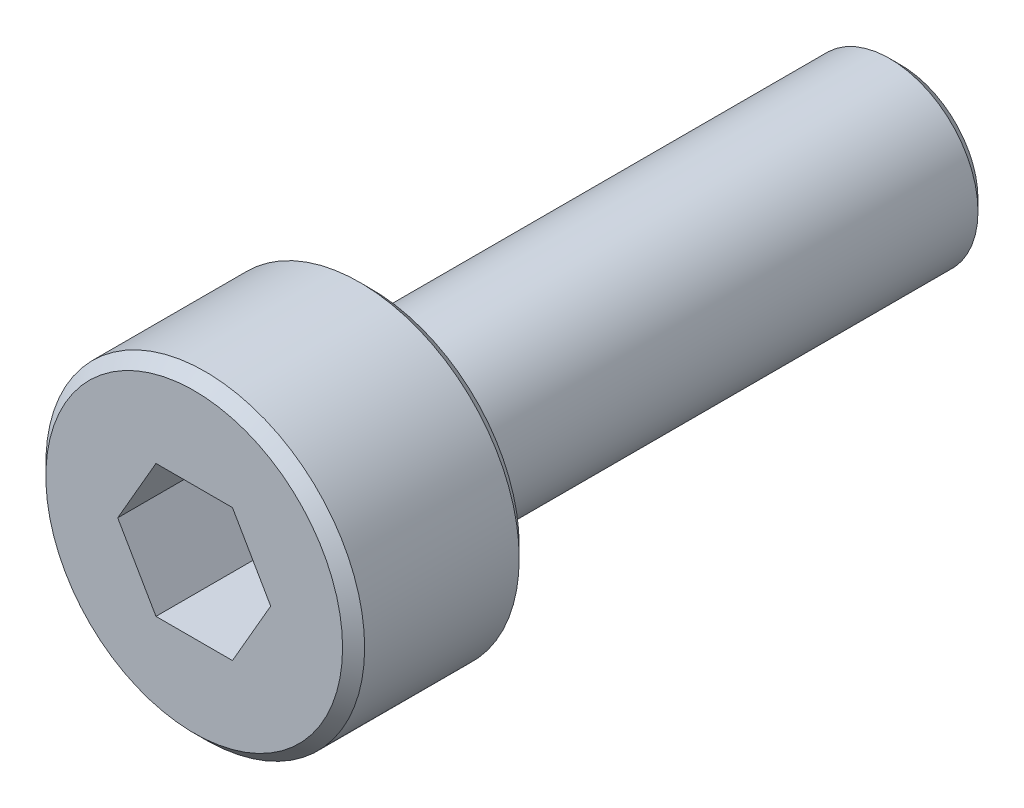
ISO-10303-21;
HEADER;
FILE_DESCRIPTION(('STEP AP214'),'2;1');
FILE_NAME('part.step','',(''),(''),'','','');
FILE_SCHEMA(('AUTOMOTIVE_DESIGN { 1 0 10303 214 1 1 1 1 }'));
ENDSEC;
DATA;
#1=APPLICATION_CONTEXT('core data for automotive mechanical design processes');
#2=APPLICATION_PROTOCOL_DEFINITION('international standard','automotive_design',2000,#1);
#3=PRODUCT_CONTEXT('',#1,'mechanical');
#4=PRODUCT('Part','Part','',(#3));
#5=PRODUCT_RELATED_PRODUCT_CATEGORY('part','',(#4));
#6=PRODUCT_DEFINITION_FORMATION('','',#4);
#7=PRODUCT_DEFINITION_CONTEXT('part definition',#1,'design');
#8=PRODUCT_DEFINITION('design','',#6,#7);
#9=PRODUCT_DEFINITION_SHAPE('','',#8);
#10=(LENGTH_UNIT() NAMED_UNIT(*) SI_UNIT(.MILLI.,.METRE.));
#11=(NAMED_UNIT(*) PLANE_ANGLE_UNIT() SI_UNIT($,.RADIAN.));
#12=(NAMED_UNIT(*) SI_UNIT($,.STERADIAN.) SOLID_ANGLE_UNIT());
#13=UNCERTAINTY_MEASURE_WITH_UNIT(LENGTH_MEASURE(1.E-05),#10,'distance_accuracy_value','');
#14=(GEOMETRIC_REPRESENTATION_CONTEXT(3) GLOBAL_UNCERTAINTY_ASSIGNED_CONTEXT((#13)) GLOBAL_UNIT_ASSIGNED_CONTEXT((#10,
#11,#12)) REPRESENTATION_CONTEXT('',''));
#15=CARTESIAN_POINT('',(0.,0.,0.));
#16=DIRECTION('',(0.,0.,1.));
#17=DIRECTION('',(1.,0.,0.));
#18=AXIS2_PLACEMENT_3D('',#15,#16,#17);
#19=CARTESIAN_POINT('',(0.,0.,12.));
#20=DIRECTION('',(0.,0.,-1.));
#21=DIRECTION('',(-1.,0.,0.));
#22=AXIS2_PLACEMENT_3D('',#19,#20,#21);
#23=CYLINDRICAL_SURFACE('',#22,2.);
#24=CARTESIAN_POINT('',(0.,0.,0.249999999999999));
#25=DIRECTION('',(0.,0.,1.));
#26=DIRECTION('',(1.,0.,0.));
#27=AXIS2_PLACEMENT_3D('',#24,#25,#26);
#28=CIRCLE('',#27,2.);
#29=CARTESIAN_POINT('',(2.,0.,0.249999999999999));
#30=VERTEX_POINT('',#29);
#31=EDGE_CURVE('E176',#30,#30,#28,.T.);
#32=ORIENTED_EDGE('',*,*,#31,.T.);
#33=EDGE_LOOP('',(#32));
#34=FACE_BOUND('',#33,.T.);
#35=CARTESIAN_POINT('',(0.,0.,12.));
#36=DIRECTION('',(0.,0.,1.));
#37=DIRECTION('',(1.,0.,0.));
#38=AXIS2_PLACEMENT_3D('',#35,#36,#37);
#39=CIRCLE('',#38,2.);
#40=CARTESIAN_POINT('',(2.,0.,12.));
#41=VERTEX_POINT('',#40);
#42=EDGE_CURVE('E162',#41,#41,#39,.T.);
#43=ORIENTED_EDGE('',*,*,#42,.F.);
#44=EDGE_LOOP('',(#43));
#45=FACE_BOUND('',#44,.T.);
#46=ADVANCED_FACE('F50',(#34,#45),#23,.T.);
#47=CARTESIAN_POINT('',(0.,0.,0.));
#48=DIRECTION('',(0.,0.,1.));
#49=DIRECTION('',(1.,0.,0.));
#50=AXIS2_PLACEMENT_3D('',#47,#48,#49);
#51=PLANE('',#50);
#52=CARTESIAN_POINT('',(0.,0.,0.));
#53=DIRECTION('',(0.,0.,1.));
#54=DIRECTION('',(1.,0.,0.));
#55=AXIS2_PLACEMENT_3D('',#52,#53,#54);
#56=CIRCLE('',#55,1.75);
#57=CARTESIAN_POINT('',(1.75,0.,0.));
#58=VERTEX_POINT('',#57);
#59=EDGE_CURVE('E179',#58,#58,#56,.F.);
#60=ORIENTED_EDGE('',*,*,#59,.T.);
#61=EDGE_LOOP('',(#60));
#62=FACE_BOUND('',#61,.T.);
#63=ADVANCED_FACE('F208',(#62),#51,.F.);
#64=CARTESIAN_POINT('',(0.,0.,16.));
#65=DIRECTION('',(0.,0.,-1.));
#66=DIRECTION('',(-1.,0.,0.));
#67=AXIS2_PLACEMENT_3D('',#64,#65,#66);
#68=CYLINDRICAL_SURFACE('',#67,3.61);
#69=CARTESIAN_POINT('',(0.,0.,12.25));
#70=DIRECTION('',(0.,0.,1.));
#71=DIRECTION('',(1.,0.,0.));
#72=AXIS2_PLACEMENT_3D('',#69,#70,#71);
#73=CIRCLE('',#72,3.61);
#74=CARTESIAN_POINT('',(3.61,0.,12.25));
#75=VERTEX_POINT('',#74);
#76=EDGE_CURVE('E190',#75,#75,#73,.T.);
#77=ORIENTED_EDGE('',*,*,#76,.T.);
#78=EDGE_LOOP('',(#77));
#79=FACE_BOUND('',#78,.T.);
#80=CARTESIAN_POINT('',(0.,0.,15.75));
#81=DIRECTION('',(0.,0.,1.));
#82=DIRECTION('',(1.,0.,0.));
#83=AXIS2_PLACEMENT_3D('',#80,#81,#82);
#84=CIRCLE('',#83,3.61);
#85=CARTESIAN_POINT('',(3.61,0.,15.75));
#86=VERTEX_POINT('',#85);
#87=EDGE_CURVE('E184',#86,#86,#84,.F.);
#88=ORIENTED_EDGE('',*,*,#87,.T.);
#89=EDGE_LOOP('',(#88));
#90=FACE_BOUND('',#89,.T.);
#91=ADVANCED_FACE('F204',(#79,#90),#68,.T.);
#92=CARTESIAN_POINT('',(0.,0.,16.));
#93=DIRECTION('',(0.,0.,1.));
#94=DIRECTION('',(1.,0.,0.));
#95=AXIS2_PLACEMENT_3D('',#92,#93,#94);
#96=PLANE('',#95);
#97=CARTESIAN_POINT('',(0.,0.,16.));
#98=DIRECTION('',(0.,0.,1.));
#99=DIRECTION('',(1.,0.,0.));
#100=AXIS2_PLACEMENT_3D('',#97,#98,#99);
#101=CIRCLE('',#100,3.36);
#102=CARTESIAN_POINT('',(3.36,0.,16.));
#103=VERTEX_POINT('',#102);
#104=EDGE_CURVE('E11',#103,#103,#101,.T.);
#105=ORIENTED_EDGE('',*,*,#104,.T.);
#106=EDGE_LOOP('',(#105));
#107=FACE_BOUND('',#106,.T.);
#108=DIRECTION('',(0.5,0.866025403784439,0.));
#109=VECTOR('',#108,1.);
#110=CARTESIAN_POINT('',(0.866025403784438,-1.5,16.));
#111=LINE('',#110,#109);
#112=CARTESIAN_POINT('',(0.866025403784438,-1.5,16.));
#113=VERTEX_POINT('',#112);
#114=CARTESIAN_POINT('',(1.73205080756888,0.,16.));
#115=VERTEX_POINT('',#114);
#116=EDGE_CURVE('E61',#113,#115,#111,.T.);
#117=ORIENTED_EDGE('',*,*,#116,.F.);
#118=DIRECTION('',(1.,0.,0.));
#119=VECTOR('',#118,1.);
#120=CARTESIAN_POINT('',(-0.866025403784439,-1.5,16.));
#121=LINE('',#120,#119);
#122=CARTESIAN_POINT('',(-0.866025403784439,-1.5,16.));
#123=VERTEX_POINT('',#122);
#124=EDGE_CURVE('E160',#123,#113,#121,.T.);
#125=ORIENTED_EDGE('',*,*,#124,.F.);
#126=DIRECTION('',(0.5,-0.866025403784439,0.));
#127=VECTOR('',#126,1.);
#128=CARTESIAN_POINT('',(-1.73205080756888,0.,16.));
#129=LINE('',#128,#127);
#130=CARTESIAN_POINT('',(-1.73205080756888,0.,16.));
#131=VERTEX_POINT('',#130);
#132=EDGE_CURVE('E152',#131,#123,#129,.T.);
#133=ORIENTED_EDGE('',*,*,#132,.F.);
#134=DIRECTION('',(-0.5,-0.866025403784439,0.));
#135=VECTOR('',#134,1.);
#136=CARTESIAN_POINT('',(-0.866025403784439,1.5,16.));
#137=LINE('',#136,#135);
#138=CARTESIAN_POINT('',(-0.866025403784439,1.5,16.));
#139=VERTEX_POINT('',#138);
#140=EDGE_CURVE('E115',#139,#131,#137,.T.);
#141=ORIENTED_EDGE('',*,*,#140,.F.);
#142=DIRECTION('',(-1.,0.,0.));
#143=VECTOR('',#142,1.);
#144=CARTESIAN_POINT('',(0.866025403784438,1.5,16.));
#145=LINE('',#144,#143);
#146=CARTESIAN_POINT('',(0.866025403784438,1.5,16.));
#147=VERTEX_POINT('',#146);
#148=EDGE_CURVE('E146',#147,#139,#145,.T.);
#149=ORIENTED_EDGE('',*,*,#148,.F.);
#150=DIRECTION('',(-0.5,0.866025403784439,0.));
#151=VECTOR('',#150,1.);
#152=CARTESIAN_POINT('',(1.73205080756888,0.,16.));
#153=LINE('',#152,#151);
#154=EDGE_CURVE('E145',#115,#147,#153,.T.);
#155=ORIENTED_EDGE('',*,*,#154,.F.);
#156=EDGE_LOOP('',(#117,#125,#133,#141,#149,#155));
#157=FACE_BOUND('',#156,.T.);
#158=ADVANCED_FACE('F210',(#107,#157),#96,.T.);
#159=CARTESIAN_POINT('',(0.,0.,12.));
#160=DIRECTION('',(0.,0.,1.));
#161=DIRECTION('',(1.,0.,0.));
#162=AXIS2_PLACEMENT_3D('',#159,#160,#161);
#163=PLANE('',#162);
#164=CARTESIAN_POINT('',(0.,0.,12.));
#165=DIRECTION('',(0.,0.,1.));
#166=DIRECTION('',(1.,0.,0.));
#167=AXIS2_PLACEMENT_3D('',#164,#165,#166);
#168=CIRCLE('',#167,3.36);
#169=CARTESIAN_POINT('',(3.36,0.,12.));
#170=VERTEX_POINT('',#169);
#171=EDGE_CURVE('E60',#170,#170,#168,.F.);
#172=ORIENTED_EDGE('',*,*,#171,.T.);
#173=EDGE_LOOP('',(#172));
#174=FACE_BOUND('',#173,.T.);
#175=ORIENTED_EDGE('',*,*,#42,.T.);
#176=EDGE_LOOP('',(#175));
#177=FACE_BOUND('',#176,.T.);
#178=ADVANCED_FACE('F194',(#174,#177),#163,.F.);
#179=CARTESIAN_POINT('',(0.866025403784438,-1.5,13.5));
#180=DIRECTION('',(0.866025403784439,-0.5,0.));
#181=DIRECTION('',(0.5,0.866025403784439,0.));
#182=AXIS2_PLACEMENT_3D('',#179,#180,#181);
#183=PLANE('',#182);
#184=ORIENTED_EDGE('',*,*,#116,.T.);
#185=DIRECTION('',(0.,0.,1.));
#186=VECTOR('',#185,1.);
#187=CARTESIAN_POINT('',(1.73205080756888,0.,13.5));
#188=LINE('',#187,#186);
#189=CARTESIAN_POINT('',(1.73205080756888,0.,13.5));
#190=VERTEX_POINT('',#189);
#191=EDGE_CURVE('E94',#190,#115,#188,.T.);
#192=ORIENTED_EDGE('',*,*,#191,.F.);
#193=DIRECTION('',(0.5,0.866025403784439,0.));
#194=VECTOR('',#193,1.);
#195=CARTESIAN_POINT('',(0.866025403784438,-1.5,13.5));
#196=LINE('',#195,#194);
#197=CARTESIAN_POINT('',(0.866025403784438,-1.5,13.5));
#198=VERTEX_POINT('',#197);
#199=EDGE_CURVE('E159',#198,#190,#196,.T.);
#200=ORIENTED_EDGE('',*,*,#199,.F.);
#201=DIRECTION('',(0.,0.,1.));
#202=VECTOR('',#201,1.);
#203=CARTESIAN_POINT('',(0.866025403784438,-1.5,13.5));
#204=LINE('',#203,#202);
#205=EDGE_CURVE('E75',#198,#113,#204,.T.);
#206=ORIENTED_EDGE('',*,*,#205,.T.);
#207=EDGE_LOOP('',(#184,#192,#200,#206));
#208=FACE_BOUND('',#207,.T.);
#209=ADVANCED_FACE('F229',(#208),#183,.F.);
#210=CARTESIAN_POINT('',(-0.866025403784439,-1.5,13.5));
#211=DIRECTION('',(0.,-1.,0.));
#212=DIRECTION('',(1.,0.,0.));
#213=AXIS2_PLACEMENT_3D('',#210,#211,#212);
#214=PLANE('',#213);
#215=ORIENTED_EDGE('',*,*,#124,.T.);
#216=ORIENTED_EDGE('',*,*,#205,.F.);
#217=DIRECTION('',(1.,0.,0.));
#218=VECTOR('',#217,1.);
#219=CARTESIAN_POINT('',(-0.866025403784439,-1.5,13.5));
#220=LINE('',#219,#218);
#221=CARTESIAN_POINT('',(-0.866025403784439,-1.5,13.5));
#222=VERTEX_POINT('',#221);
#223=EDGE_CURVE('E127',#222,#198,#220,.T.);
#224=ORIENTED_EDGE('',*,*,#223,.F.);
#225=DIRECTION('',(0.,0.,1.));
#226=VECTOR('',#225,1.);
#227=CARTESIAN_POINT('',(-0.866025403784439,-1.5,13.5));
#228=LINE('',#227,#226);
#229=EDGE_CURVE('E119',#222,#123,#228,.T.);
#230=ORIENTED_EDGE('',*,*,#229,.T.);
#231=EDGE_LOOP('',(#215,#216,#224,#230));
#232=FACE_BOUND('',#231,.T.);
#233=ADVANCED_FACE('F226',(#232),#214,.F.);
#234=CARTESIAN_POINT('',(-1.73205080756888,0.,13.5));
#235=DIRECTION('',(-0.866025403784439,-0.5,0.));
#236=DIRECTION('',(0.5,-0.866025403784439,0.));
#237=AXIS2_PLACEMENT_3D('',#234,#235,#236);
#238=PLANE('',#237);
#239=ORIENTED_EDGE('',*,*,#132,.T.);
#240=ORIENTED_EDGE('',*,*,#229,.F.);
#241=DIRECTION('',(0.5,-0.866025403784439,0.));
#242=VECTOR('',#241,1.);
#243=CARTESIAN_POINT('',(-1.73205080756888,0.,13.5));
#244=LINE('',#243,#242);
#245=CARTESIAN_POINT('',(-1.73205080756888,0.,13.5));
#246=VERTEX_POINT('',#245);
#247=EDGE_CURVE('E121',#246,#222,#244,.T.);
#248=ORIENTED_EDGE('',*,*,#247,.F.);
#249=DIRECTION('',(0.,0.,1.));
#250=VECTOR('',#249,1.);
#251=CARTESIAN_POINT('',(-1.73205080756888,0.,13.5));
#252=LINE('',#251,#250);
#253=EDGE_CURVE('E104',#246,#131,#252,.T.);
#254=ORIENTED_EDGE('',*,*,#253,.T.);
#255=EDGE_LOOP('',(#239,#240,#248,#254));
#256=FACE_BOUND('',#255,.T.);
#257=ADVANCED_FACE('F125',(#256),#238,.F.);
#258=CARTESIAN_POINT('',(-0.866025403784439,1.5,13.5));
#259=DIRECTION('',(-0.866025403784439,0.5,0.));
#260=DIRECTION('',(-0.5,-0.866025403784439,0.));
#261=AXIS2_PLACEMENT_3D('',#258,#259,#260);
#262=PLANE('',#261);
#263=ORIENTED_EDGE('',*,*,#140,.T.);
#264=ORIENTED_EDGE('',*,*,#253,.F.);
#265=DIRECTION('',(-0.5,-0.866025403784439,0.));
#266=VECTOR('',#265,1.);
#267=CARTESIAN_POINT('',(-0.866025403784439,1.5,13.5));
#268=LINE('',#267,#266);
#269=CARTESIAN_POINT('',(-0.866025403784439,1.5,13.5));
#270=VERTEX_POINT('',#269);
#271=EDGE_CURVE('E108',#270,#246,#268,.T.);
#272=ORIENTED_EDGE('',*,*,#271,.F.);
#273=DIRECTION('',(0.,0.,1.));
#274=VECTOR('',#273,1.);
#275=CARTESIAN_POINT('',(-0.866025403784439,1.5,13.5));
#276=LINE('',#275,#274);
#277=EDGE_CURVE('E120',#270,#139,#276,.T.);
#278=ORIENTED_EDGE('',*,*,#277,.T.);
#279=EDGE_LOOP('',(#263,#264,#272,#278));
#280=FACE_BOUND('',#279,.T.);
#281=ADVANCED_FACE('F110',(#280),#262,.F.);
#282=CARTESIAN_POINT('',(0.866025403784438,1.5,13.5));
#283=DIRECTION('',(0.,1.,0.));
#284=DIRECTION('',(-1.,0.,0.));
#285=AXIS2_PLACEMENT_3D('',#282,#283,#284);
#286=PLANE('',#285);
#287=ORIENTED_EDGE('',*,*,#148,.T.);
#288=ORIENTED_EDGE('',*,*,#277,.F.);
#289=DIRECTION('',(-1.,0.,0.));
#290=VECTOR('',#289,1.);
#291=CARTESIAN_POINT('',(0.866025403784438,1.5,13.5));
#292=LINE('',#291,#290);
#293=CARTESIAN_POINT('',(0.866025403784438,1.5,13.5));
#294=VERTEX_POINT('',#293);
#295=EDGE_CURVE('E134',#294,#270,#292,.T.);
#296=ORIENTED_EDGE('',*,*,#295,.F.);
#297=DIRECTION('',(0.,0.,1.));
#298=VECTOR('',#297,1.);
#299=CARTESIAN_POINT('',(0.866025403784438,1.5,13.5));
#300=LINE('',#299,#298);
#301=EDGE_CURVE('E169',#294,#147,#300,.T.);
#302=ORIENTED_EDGE('',*,*,#301,.T.);
#303=EDGE_LOOP('',(#287,#288,#296,#302));
#304=FACE_BOUND('',#303,.T.);
#305=ADVANCED_FACE('F268',(#304),#286,.F.);
#306=CARTESIAN_POINT('',(1.73205080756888,0.,13.5));
#307=DIRECTION('',(0.866025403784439,0.5,0.));
#308=DIRECTION('',(-0.5,0.866025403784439,0.));
#309=AXIS2_PLACEMENT_3D('',#306,#307,#308);
#310=PLANE('',#309);
#311=ORIENTED_EDGE('',*,*,#154,.T.);
#312=ORIENTED_EDGE('',*,*,#301,.F.);
#313=DIRECTION('',(-0.5,0.866025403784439,0.));
#314=VECTOR('',#313,1.);
#315=CARTESIAN_POINT('',(1.73205080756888,0.,13.5));
#316=LINE('',#315,#314);
#317=EDGE_CURVE('E136',#190,#294,#316,.T.);
#318=ORIENTED_EDGE('',*,*,#317,.F.);
#319=ORIENTED_EDGE('',*,*,#191,.T.);
#320=EDGE_LOOP('',(#311,#312,#318,#319));
#321=FACE_BOUND('',#320,.T.);
#322=ADVANCED_FACE('F224',(#321),#310,.F.);
#323=CARTESIAN_POINT('',(0.,0.,13.5));
#324=DIRECTION('',(0.,0.,1.));
#325=DIRECTION('',(1.,0.,0.));
#326=AXIS2_PLACEMENT_3D('',#323,#324,#325);
#327=PLANE('',#326);
#328=ORIENTED_EDGE('',*,*,#199,.T.);
#329=ORIENTED_EDGE('',*,*,#317,.T.);
#330=ORIENTED_EDGE('',*,*,#295,.T.);
#331=ORIENTED_EDGE('',*,*,#271,.T.);
#332=ORIENTED_EDGE('',*,*,#247,.T.);
#333=ORIENTED_EDGE('',*,*,#223,.T.);
#334=EDGE_LOOP('',(#328,#329,#330,#331,#332,#333));
#335=FACE_BOUND('',#334,.T.);
#336=ADVANCED_FACE('F129',(#335),#327,.T.);
#337=CARTESIAN_POINT('',(0.,0.,0.249999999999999));
#338=DIRECTION('',(0.,0.,1.));
#339=DIRECTION('',(1.,0.,0.));
#340=AXIS2_PLACEMENT_3D('',#337,#338,#339);
#341=CONICAL_SURFACE('',#340,2.,0.785398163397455);
#342=ORIENTED_EDGE('',*,*,#59,.F.);
#343=EDGE_LOOP('',(#342));
#344=FACE_BOUND('',#343,.T.);
#345=ORIENTED_EDGE('',*,*,#31,.F.);
#346=EDGE_LOOP('',(#345));
#347=FACE_BOUND('',#346,.T.);
#348=ADVANCED_FACE('F203',(#344,#347),#341,.T.);
#349=CARTESIAN_POINT('',(0.,0.,12.25));
#350=DIRECTION('',(0.,0.,1.));
#351=DIRECTION('',(1.,0.,0.));
#352=AXIS2_PLACEMENT_3D('',#349,#350,#351);
#353=CONICAL_SURFACE('',#352,3.61,0.785398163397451);
#354=ORIENTED_EDGE('',*,*,#171,.F.);
#355=EDGE_LOOP('',(#354));
#356=FACE_BOUND('',#355,.T.);
#357=ORIENTED_EDGE('',*,*,#76,.F.);
#358=EDGE_LOOP('',(#357));
#359=FACE_BOUND('',#358,.T.);
#360=ADVANCED_FACE('F196',(#356,#359),#353,.T.);
#361=CARTESIAN_POINT('',(0.,0.,16.));
#362=DIRECTION('',(0.,0.,-1.));
#363=DIRECTION('',(-1.,0.,0.));
#364=AXIS2_PLACEMENT_3D('',#361,#362,#363);
#365=CONICAL_SURFACE('',#364,3.36,0.785398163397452);
#366=ORIENTED_EDGE('',*,*,#87,.F.);
#367=EDGE_LOOP('',(#366));
#368=FACE_BOUND('',#367,.T.);
#369=ORIENTED_EDGE('',*,*,#104,.F.);
#370=EDGE_LOOP('',(#369));
#371=FACE_BOUND('',#370,.T.);
#372=ADVANCED_FACE('F49',(#368,#371),#365,.T.);
#373=CLOSED_SHELL('',(#46,#63,#91,#158,#178,#209,#233,#257,#281,#305,#322,#336,#348,#360,#372));
#374=MANIFOLD_SOLID_BREP('B2',#373);
#375=ADVANCED_BREP_SHAPE_REPRESENTATION('',(#18,#374),#14);
#376=SHAPE_DEFINITION_REPRESENTATION(#9,#375);
ENDSEC;
END-ISO-10303-21;
